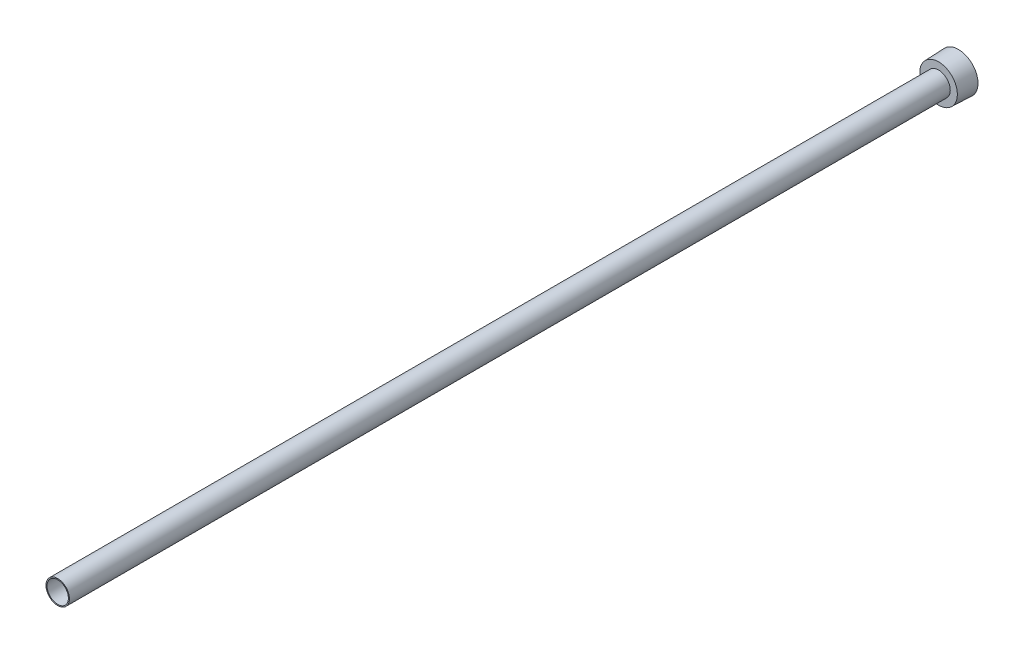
from build123d import *

# Parameters (mm, degrees)
SKETCH2_R          = 7.2263
CUT_EXTRUDE1_DEPTH = 610.886656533
CUT_EXTRUDE2_DEPTH = 9.525


with BuildPart() as part:
    # Sketch1 → Revolve1 (revolve)
    with BuildSketch(Plane(origin=(0, 0, 0), x_dir=(0, 0, -1), z_dir=(1, 0, 0)), mode=Mode.PRIVATE) as revolve1_sk:
        Polygon((-609.6, 0), (0, 0), (0, 13.2207), (-13.4874, 12.728732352), (-13.4874, 7.9375), (-609.6, 7.9375), align=None)
    revolve(revolve1_sk.sketch.rotate(Axis((0, 0, 278.001114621), (0, 0, -1)), 90), axis=Axis((0, 0, 278.001114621), (0, 0, -1)))

    # Sketch2 → Cut-Extrude1 (cut, through all)
    with BuildSketch(Plane.XY.offset(609.6)):
        Circle(SKETCH2_R)
    extrude(amount=-CUT_EXTRUDE1_DEPTH, mode=Mode.SUBTRACT)

    # Sketch3 → Cut-Extrude2 (cut)
    with BuildSketch(Plane(origin=(0, 0, 0), x_dir=(-1, 0, 0), z_dir=(0, 0, -1))):
        Polygon((0, -10.998522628), (9.525, -5.499261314), (9.525, 5.499261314), (0, 10.998522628), (-9.525, 5.499261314), (-9.525, -5.499261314), align=None)
    extrude(amount=-CUT_EXTRUDE2_DEPTH, mode=Mode.SUBTRACT)


solid = part.part
